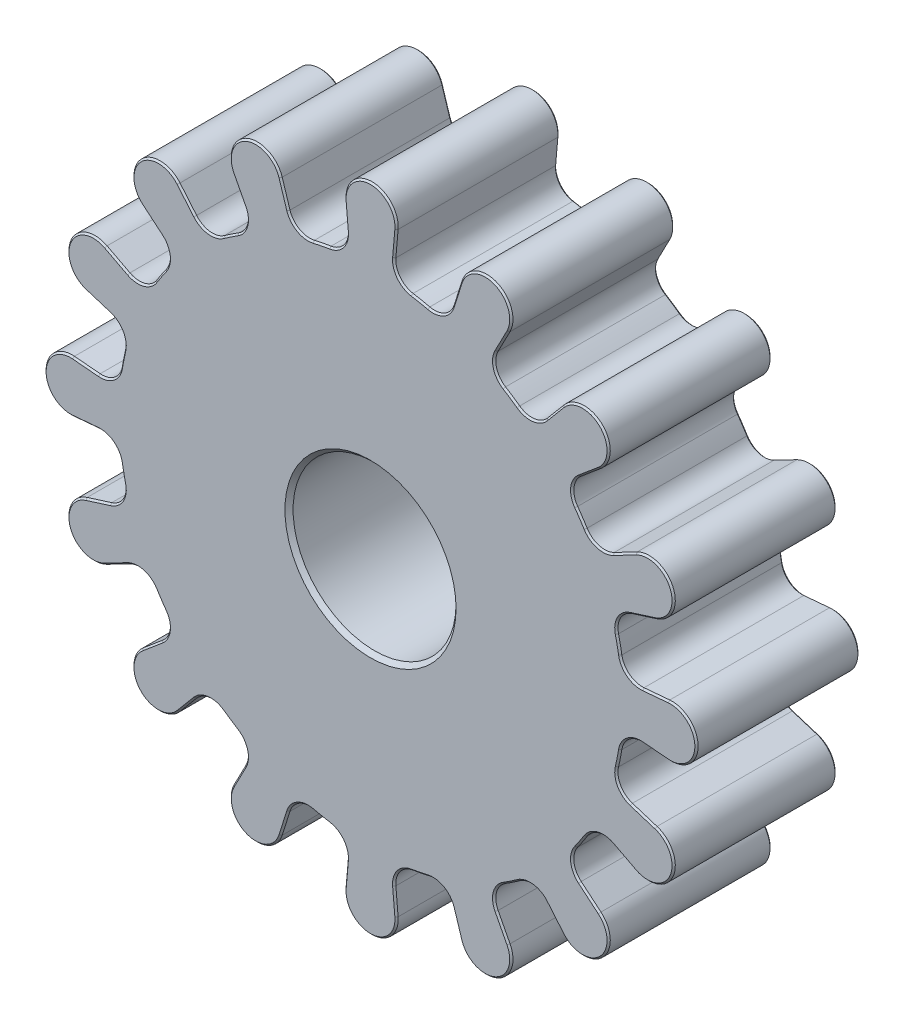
from build123d import *

# Parameters (mm, degrees)
SKETCH_1_R      = 5
EXTRUDE_1_DEPTH = 10
CHAMFER_1_SIZE  = 0.25
CHAMFER_2_SIZE  = 0.1


with BuildPart() as part:
    # Sketch 1 → Extrude 1 (new body)
    with BuildSketch(Plane.XY):
        with BuildLine():
            Line((-1.456253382, 16.683478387), (-1.593939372, 18.260869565))
            ThreePointArc((-1.593939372, 18.260869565), (0, 20), (1.593939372, 18.260869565))
            Line((1.593939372, 18.260869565), (1.456253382, 16.683478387))
            ThreePointArc((1.456253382, 16.683478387), (1.718531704, 15.793897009), (2.515653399, 15.319827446))
            ThreePointArc((2.515653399, 15.319827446), (3.028777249, 15.226691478), (3.538483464, 15.116373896))
            ThreePointArc((3.538483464, 15.116373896), (4.45634645, 15.249311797), (5.039088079, 15.970808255))
            Line((5.039088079, 15.970808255), (5.515524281, 17.480817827))
            ThreePointArc((5.515524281, 17.480817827), (7.653668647, 18.47759065), (8.460740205, 16.260869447))
            Line((8.460740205, 16.260869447), (7.729893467, 14.85624017))
            ThreePointArc((7.729893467, 14.85624017), (7.631778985, 13.934004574), (8.186804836, 13.190976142))
            ThreePointArc((8.186804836, 13.190976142), (8.625227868, 12.908565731), (9.053918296, 12.611589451))
            ThreePointArc((9.053918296, 12.611589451), (9.952786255, 12.383157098), (10.76727406, 12.826727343))
            Line((10.76727406, 12.826727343), (11.785299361, 14.039470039))
            ThreePointArc((11.785299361, 14.039470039), (14.142135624, 14.142135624), (14.039470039, 11.785299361))
            Line((14.039470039, 11.785299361), (12.826727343, 10.76727406))
            ThreePointArc((12.826727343, 10.76727406), (12.383157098, 9.952786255), (12.611589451, 9.053918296))
            ThreePointArc((12.611589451, 9.053918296), (12.908565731, 8.625227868), (13.190976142, 8.186804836))
            ThreePointArc((13.190976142, 8.186804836), (13.934004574, 7.631778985), (14.85624017, 7.729893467))
            Line((14.85624017, 7.729893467), (16.260869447, 8.460740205))
            ThreePointArc((16.260869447, 8.460740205), (18.47759065, 7.653668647), (17.480817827, 5.515524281))
            Line((17.480817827, 5.515524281), (15.970808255, 5.039088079))
            ThreePointArc((15.970808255, 5.039088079), (15.249311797, 4.45634645), (15.116373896, 3.538483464))
            ThreePointArc((15.116373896, 3.538483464), (15.226691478, 3.028777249), (15.319827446, 2.515653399))
            ThreePointArc((15.319827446, 2.515653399), (15.793897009, 1.718531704), (16.683478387, 1.456253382))
            Line((16.683478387, 1.456253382), (18.260869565, 1.593939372))
            ThreePointArc((18.260869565, 1.593939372), (20, 0), (18.260869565, -1.593939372))
            Line((18.260869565, -1.593939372), (16.683478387, -1.456253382))
            ThreePointArc((16.683478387, -1.456253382), (15.793897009, -1.718531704), (15.319827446, -2.515653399))
            ThreePointArc((15.319827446, -2.515653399), (15.226691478, -3.028777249), (15.116373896, -3.538483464))
            ThreePointArc((15.116373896, -3.538483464), (15.249311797, -4.45634645), (15.970808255, -5.039088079))
            Line((15.970808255, -5.039088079), (17.480817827, -5.515524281))
            ThreePointArc((17.480817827, -5.515524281), (18.47759065, -7.653668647), (16.260869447, -8.460740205))
            Line((16.260869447, -8.460740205), (14.85624017, -7.729893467))
            ThreePointArc((14.85624017, -7.729893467), (13.934004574, -7.631778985), (13.190976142, -8.186804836))
            ThreePointArc((13.190976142, -8.186804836), (12.908565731, -8.625227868), (12.611589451, -9.053918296))
            ThreePointArc((12.611589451, -9.053918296), (12.383157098, -9.952786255), (12.826727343, -10.76727406))
            Line((12.826727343, -10.76727406), (14.039470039, -11.785299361))
            ThreePointArc((14.039470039, -11.785299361), (14.142135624, -14.142135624), (11.785299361, -14.039470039))
            Line((11.785299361, -14.039470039), (10.76727406, -12.826727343))
            ThreePointArc((10.76727406, -12.826727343), (9.952786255, -12.383157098), (9.053918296, -12.611589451))
            ThreePointArc((9.053918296, -12.611589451), (8.625227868, -12.908565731), (8.186804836, -13.190976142))
            ThreePointArc((8.186804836, -13.190976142), (7.631778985, -13.934004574), (7.729893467, -14.85624017))
            Line((7.729893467, -14.85624017), (8.460740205, -16.260869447))
            ThreePointArc((8.460740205, -16.260869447), (7.653668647, -18.47759065), (5.515524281, -17.480817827))
            Line((5.515524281, -17.480817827), (5.039088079, -15.970808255))
            ThreePointArc((5.039088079, -15.970808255), (4.45634645, -15.249311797), (3.538483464, -15.116373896))
            ThreePointArc((3.538483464, -15.116373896), (3.028777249, -15.226691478), (2.515653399, -15.319827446))
            ThreePointArc((2.515653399, -15.319827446), (1.718531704, -15.793897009), (1.456253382, -16.683478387))
            Line((1.456253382, -16.683478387), (1.593939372, -18.260869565))
            ThreePointArc((1.593939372, -18.260869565), (0, -20), (-1.593939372, -18.260869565))
            Line((-1.593939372, -18.260869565), (-1.456253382, -16.683478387))
            ThreePointArc((-1.456253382, -16.683478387), (-1.718531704, -15.793897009), (-2.515653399, -15.319827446))
            ThreePointArc((-2.515653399, -15.319827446), (-3.028777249, -15.226691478), (-3.538483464, -15.116373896))
            ThreePointArc((-3.538483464, -15.116373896), (-4.45634645, -15.249311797), (-5.039088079, -15.970808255))
            Line((-5.039088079, -15.970808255), (-5.515524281, -17.480817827))
            ThreePointArc((-5.515524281, -17.480817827), (-7.653668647, -18.47759065), (-8.460740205, -16.260869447))
            Line((-8.460740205, -16.260869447), (-7.729893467, -14.85624017))
            ThreePointArc((-7.729893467, -14.85624017), (-7.631778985, -13.934004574), (-8.186804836, -13.190976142))
            ThreePointArc((-8.186804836, -13.190976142), (-8.625227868, -12.908565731), (-9.053918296, -12.611589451))
            ThreePointArc((-9.053918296, -12.611589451), (-9.952786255, -12.383157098), (-10.76727406, -12.826727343))
            Line((-10.76727406, -12.826727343), (-11.785299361, -14.039470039))
            ThreePointArc((-11.785299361, -14.039470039), (-14.142135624, -14.142135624), (-14.039470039, -11.785299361))
            Line((-14.039470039, -11.785299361), (-12.826727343, -10.76727406))
            ThreePointArc((-12.826727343, -10.76727406), (-12.383157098, -9.952786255), (-12.611589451, -9.053918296))
            ThreePointArc((-12.611589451, -9.053918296), (-12.908565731, -8.625227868), (-13.190976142, -8.186804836))
            ThreePointArc((-13.190976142, -8.186804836), (-13.934004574, -7.631778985), (-14.85624017, -7.729893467))
            Line((-14.85624017, -7.729893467), (-16.260869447, -8.460740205))
            ThreePointArc((-16.260869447, -8.460740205), (-18.47759065, -7.653668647), (-17.480817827, -5.515524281))
            Line((-17.480817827, -5.515524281), (-15.970808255, -5.039088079))
            ThreePointArc((-15.970808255, -5.039088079), (-15.249311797, -4.45634645), (-15.116373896, -3.538483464))
            ThreePointArc((-15.116373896, -3.538483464), (-15.226691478, -3.028777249), (-15.319827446, -2.515653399))
            ThreePointArc((-15.319827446, -2.515653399), (-15.793897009, -1.718531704), (-16.683478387, -1.456253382))
            Line((-16.683478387, -1.456253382), (-18.260869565, -1.593939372))
            ThreePointArc((-18.260869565, -1.593939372), (-20, 0), (-18.260869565, 1.593939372))
            Line((-18.260869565, 1.593939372), (-16.683478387, 1.456253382))
            ThreePointArc((-16.683478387, 1.456253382), (-15.793897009, 1.718531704), (-15.319827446, 2.515653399))
            ThreePointArc((-15.319827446, 2.515653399), (-15.226691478, 3.028777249), (-15.116373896, 3.538483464))
            ThreePointArc((-15.116373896, 3.538483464), (-15.249311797, 4.45634645), (-15.970808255, 5.039088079))
            Line((-15.970808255, 5.039088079), (-17.480817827, 5.515524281))
            ThreePointArc((-17.480817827, 5.515524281), (-18.47759065, 7.653668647), (-16.260869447, 8.460740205))
            Line((-16.260869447, 8.460740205), (-14.85624017, 7.729893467))
            ThreePointArc((-14.85624017, 7.729893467), (-13.934004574, 7.631778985), (-13.190976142, 8.186804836))
            ThreePointArc((-13.190976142, 8.186804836), (-12.908565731, 8.625227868), (-12.611589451, 9.053918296))
            ThreePointArc((-12.611589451, 9.053918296), (-12.383157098, 9.952786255), (-12.826727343, 10.76727406))
            Line((-12.826727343, 10.76727406), (-14.039470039, 11.785299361))
            ThreePointArc((-14.039470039, 11.785299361), (-14.142135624, 14.142135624), (-11.785299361, 14.039470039))
            Line((-11.785299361, 14.039470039), (-10.76727406, 12.826727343))
            ThreePointArc((-10.76727406, 12.826727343), (-9.952786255, 12.383157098), (-9.053918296, 12.611589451))
            ThreePointArc((-9.053918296, 12.611589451), (-8.625227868, 12.908565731), (-8.186804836, 13.190976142))
            ThreePointArc((-8.186804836, 13.190976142), (-7.631778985, 13.934004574), (-7.729893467, 14.85624017))
            Line((-7.729893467, 14.85624017), (-8.460740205, 16.260869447))
            ThreePointArc((-8.460740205, 16.260869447), (-7.653668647, 18.47759065), (-5.515524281, 17.480817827))
            Line((-5.515524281, 17.480817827), (-5.039088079, 15.970808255))
            ThreePointArc((-5.039088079, 15.970808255), (-4.45634645, 15.249311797), (-3.538483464, 15.116373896))
            ThreePointArc((-3.538483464, 15.116373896), (-3.028777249, 15.226691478), (-2.515653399, 15.319827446))
            ThreePointArc((-2.515653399, 15.319827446), (-1.718531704, 15.793897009), (-1.456253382, 16.683478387))
        make_face()
        Circle(SKETCH_1_R, mode=Mode.SUBTRACT)
    extrude(amount=EXTRUDE_1_DEPTH)

    # Chamfer 1
    chamfer_1_edges = [part.edges().sort_by_distance(p)[0] for p in [
        (-5, 0, 0),
        (-5, 0, 10),
    ]]
    chamfer(chamfer_1_edges, length=CHAMFER_1_SIZE)

    # Chamfer 2
    chamfer_2_edges = [part.edges().sort_by_distance(p)[0] for p in [
        (-1.718531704, 15.793897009, 10),
        (-13.934004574, -7.631778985, 10),
        (-7.631778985, -13.934004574, 0),
        (-8.625227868, -12.908565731, 0),
        (-9.952786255, -12.383157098, 0),
        (-11.27628671, -13.433098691, 0),
        (-14.142135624, -14.142135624, 0),
        (-13.433098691, -11.27628671, 0),
        (-12.383157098, -9.952786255, 0),
        (-12.908565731, -8.625227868, 0),
        (-12.908565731, -8.625227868, 10),
        (-13.934004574, -7.631778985, 0),
        (-15.558554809, -8.095316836, 0),
        (-18.47759065, -7.653668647, 0),
        (-16.725813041, -5.27730618, 0),
        (-15.249311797, -4.45634645, 0),
        (-15.226691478, -3.028777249, 0),
        (-15.793897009, -1.718531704, 0),
        (-12.383157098, -9.952786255, 10),
        (-17.472173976, -1.525096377, 0),
        (-20, 0, 0),
        (-17.472173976, 1.525096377, 0),
        (-15.793897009, 1.718531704, 0),
        (-15.226691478, 3.028777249, 0),
        (-15.249311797, 4.45634645, 0),
        (-16.725813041, 5.27730618, 0),
        (-18.47759065, 7.653668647, 0),
        (-13.433098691, -11.27628671, 10),
        (-15.558554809, 8.095316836, 0),
        (-13.934004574, 7.631778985, 0),
        (-12.908565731, 8.625227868, 0),
        (-12.383157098, 9.952786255, 0),
        (-13.433098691, 11.27628671, 0),
        (-14.142135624, 14.142135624, 0),
        (-11.27628671, 13.433098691, 0),
        (-14.142135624, -14.142135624, 10),
        (-9.952786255, 12.383157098, 0),
        (-8.625227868, 12.908565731, 0),
        (-7.631778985, 13.934004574, 0),
        (-8.095316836, 15.558554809, 0),
        (-7.653668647, 18.47759065, 0),
        (-5.27730618, 16.725813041, 0),
        (-4.45634645, 15.249311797, 0),
        (-3.028777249, 15.226691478, 0),
        (-11.27628671, -13.433098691, 10),
        (-1.718531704, 15.793897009, 0),
        (-1.525096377, 17.472173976, 0),
        (0, 20, 0),
        (-9.952786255, -12.383157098, 10),
        (-8.625227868, -12.908565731, 10),
        (-7.631778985, -13.934004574, 10),
        (-8.095316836, -15.558554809, 10),
        (-3.028777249, 15.226691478, 10),
        (-7.653668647, -18.47759065, 10),
        (-5.27730618, -16.725813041, 10),
        (-4.45634645, -15.249311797, 10),
        (-3.028777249, -15.226691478, 10),
        (-1.718531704, -15.793897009, 10),
        (-1.525096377, -17.472173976, 10),
        (0, -20, 10),
        (1.525096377, -17.472173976, 10),
        (1.718531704, -15.793897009, 10),
        (3.028777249, -15.226691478, 10),
        (-4.45634645, 15.249311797, 10),
        (4.45634645, -15.249311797, 10),
        (5.27730618, -16.725813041, 10),
        (7.653668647, -18.47759065, 10),
        (8.095316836, -15.558554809, 10),
        (7.631778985, -13.934004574, 10),
        (8.625227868, -12.908565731, 10),
        (9.952786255, -12.383157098, 10),
        (11.27628671, -13.433098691, 10),
        (14.142135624, -14.142135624, 10),
        (13.433098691, -11.27628671, 10),
        (-5.27730618, 16.725813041, 10),
        (12.383157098, -9.952786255, 10),
        (12.908565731, -8.625227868, 10),
        (13.934004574, -7.631778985, 10),
        (15.558554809, -8.095316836, 10),
        (18.47759065, -7.653668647, 10),
        (16.725813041, -5.27730618, 10),
        (15.249311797, -4.45634645, 10),
        (15.226691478, -3.028777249, 10),
        (15.793897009, -1.718531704, 10),
        (17.472173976, -1.525096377, 10),
        (-7.653668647, 18.47759065, 10),
        (20, 0, 10),
        (17.472173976, 1.525096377, 10),
        (15.793897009, 1.718531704, 10),
        (15.226691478, 3.028777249, 10),
        (15.249311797, 4.45634645, 10),
        (16.725813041, 5.27730618, 10),
        (18.47759065, 7.653668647, 10),
        (15.558554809, 8.095316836, 10),
        (13.934004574, 7.631778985, 10),
        (12.908565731, 8.625227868, 10),
        (-8.095316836, 15.558554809, 10),
        (12.383157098, 9.952786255, 10),
        (13.433098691, 11.27628671, 10),
        (14.142135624, 14.142135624, 10),
        (11.27628671, 13.433098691, 10),
        (9.952786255, 12.383157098, 10),
        (8.625227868, 12.908565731, 10),
        (7.631778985, 13.934004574, 10),
        (8.095316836, 15.558554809, 10),
        (7.653668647, 18.47759065, 10),
        (5.27730618, 16.725813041, 10),
        (-7.631778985, 13.934004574, 10),
        (4.45634645, 15.249311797, 10),
        (3.028777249, 15.226691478, 10),
        (1.718531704, 15.793897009, 10),
        (1.525096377, 17.472173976, 10),
        (-8.625227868, 12.908565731, 10),
        (-9.952786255, 12.383157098, 10),
        (-11.27628671, 13.433098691, 10),
        (0, 20, 10),
        (-14.142135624, 14.142135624, 10),
        (-13.433098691, 11.27628671, 10),
        (-12.383157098, 9.952786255, 10),
        (-12.908565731, 8.625227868, 10),
        (-13.934004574, 7.631778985, 10),
        (-15.558554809, 8.095316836, 10),
        (-18.47759065, 7.653668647, 10),
        (-16.725813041, 5.27730618, 10),
        (-15.249311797, 4.45634645, 10),
        (-15.226691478, 3.028777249, 10),
        (-1.525096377, 17.472173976, 10),
        (-15.793897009, 1.718531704, 10),
        (-17.472173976, 1.525096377, 10),
        (-20, 0, 10),
        (1.525096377, 17.472173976, 0),
        (1.718531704, 15.793897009, 0),
        (3.028777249, 15.226691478, 0),
        (-17.472173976, -1.525096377, 10),
        (4.45634645, 15.249311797, 0),
        (5.27730618, 16.725813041, 0),
        (7.653668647, 18.47759065, 0),
        (8.095316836, 15.558554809, 0),
        (7.631778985, 13.934004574, 0),
        (8.625227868, 12.908565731, 0),
        (9.952786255, 12.383157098, 0),
        (-15.793897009, -1.718531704, 10),
        (11.27628671, 13.433098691, 0),
        (14.142135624, 14.142135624, 0),
        (13.433098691, 11.27628671, 0),
        (12.383157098, 9.952786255, 0),
        (12.908565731, 8.625227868, 0),
        (13.934004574, 7.631778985, 0),
        (15.558554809, 8.095316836, 0),
        (18.47759065, 7.653668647, 0),
        (-15.226691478, -3.028777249, 10),
        (16.725813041, 5.27730618, 0),
        (15.249311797, 4.45634645, 0),
        (15.226691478, 3.028777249, 0),
        (15.793897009, 1.718531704, 0),
        (17.472173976, 1.525096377, 0),
        (20, 0, 0),
        (17.472173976, -1.525096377, 0),
        (-15.249311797, -4.45634645, 10),
        (15.793897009, -1.718531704, 0),
        (15.226691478, -3.028777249, 0),
        (15.249311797, -4.45634645, 0),
        (16.725813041, -5.27730618, 0),
        (18.47759065, -7.653668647, 0),
        (15.558554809, -8.095316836, 0),
        (13.934004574, -7.631778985, 0),
        (12.908565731, -8.625227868, 0),
        (-16.725813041, -5.27730618, 10),
        (12.383157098, -9.952786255, 0),
        (13.433098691, -11.27628671, 0),
        (14.142135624, -14.142135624, 0),
        (11.27628671, -13.433098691, 0),
        (9.952786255, -12.383157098, 0),
        (8.625227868, -12.908565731, 0),
        (7.631778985, -13.934004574, 0),
        (-18.47759065, -7.653668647, 10),
        (8.095316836, -15.558554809, 0),
        (7.653668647, -18.47759065, 0),
        (5.27730618, -16.725813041, 0),
        (4.45634645, -15.249311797, 0),
        (3.028777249, -15.226691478, 0),
        (1.718531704, -15.793897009, 0),
        (1.525096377, -17.472173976, 0),
        (0, -20, 0),
        (-15.558554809, -8.095316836, 10),
        (-1.525096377, -17.472173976, 0),
        (-1.718531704, -15.793897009, 0),
        (-3.028777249, -15.226691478, 0),
        (-4.45634645, -15.249311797, 0),
        (-5.27730618, -16.725813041, 0),
        (-7.653668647, -18.47759065, 0),
        (-8.095316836, -15.558554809, 0),
    ]]
    chamfer(chamfer_2_edges, length=CHAMFER_2_SIZE)


solid = part.part
